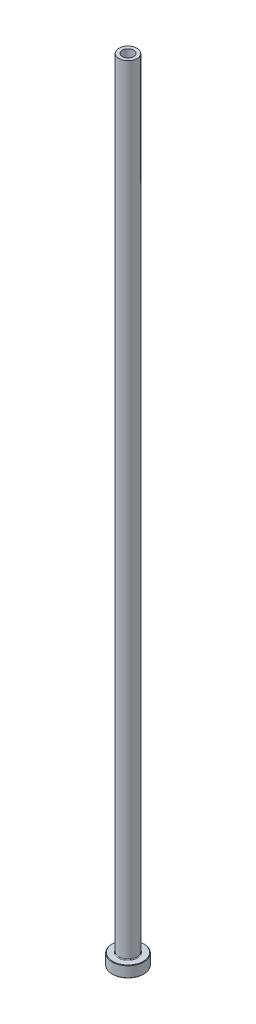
ISO-10303-21;
HEADER;
FILE_DESCRIPTION(('STEP AP214'),'2;1');
FILE_NAME('part.step','',(''),(''),'','','');
FILE_SCHEMA(('AUTOMOTIVE_DESIGN { 1 0 10303 214 1 1 1 1 }'));
ENDSEC;
DATA;
#1=APPLICATION_CONTEXT('core data for automotive mechanical design processes');
#2=APPLICATION_PROTOCOL_DEFINITION('international standard','automotive_design',2000,#1);
#3=PRODUCT_CONTEXT('',#1,'mechanical');
#4=PRODUCT('Part','Part','',(#3));
#5=PRODUCT_RELATED_PRODUCT_CATEGORY('part','',(#4));
#6=PRODUCT_DEFINITION_FORMATION('','',#4);
#7=PRODUCT_DEFINITION_CONTEXT('part definition',#1,'design');
#8=PRODUCT_DEFINITION('design','',#6,#7);
#9=PRODUCT_DEFINITION_SHAPE('','',#8);
#10=(LENGTH_UNIT() NAMED_UNIT(*) SI_UNIT(.MILLI.,.METRE.));
#11=(NAMED_UNIT(*) PLANE_ANGLE_UNIT() SI_UNIT($,.RADIAN.));
#12=(NAMED_UNIT(*) SI_UNIT($,.STERADIAN.) SOLID_ANGLE_UNIT());
#13=UNCERTAINTY_MEASURE_WITH_UNIT(LENGTH_MEASURE(1.E-05),#10,'distance_accuracy_value','');
#14=(GEOMETRIC_REPRESENTATION_CONTEXT(3) GLOBAL_UNCERTAINTY_ASSIGNED_CONTEXT((#13)) GLOBAL_UNIT_ASSIGNED_CONTEXT((#10,
#11,#12)) REPRESENTATION_CONTEXT('',''));
#15=CARTESIAN_POINT('',(0.,0.,0.));
#16=DIRECTION('',(0.,0.,1.));
#17=DIRECTION('',(1.,0.,0.));
#18=AXIS2_PLACEMENT_3D('',#15,#16,#17);
#19=CARTESIAN_POINT('',(0.,92.1876809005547,0.));
#20=DIRECTION('',(0.,1.,0.));
#21=DIRECTION('',(0.,0.,1.));
#22=AXIS2_PLACEMENT_3D('',#19,#20,#21);
#23=CYLINDRICAL_SURFACE('',#22,2.50000000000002);
#24=CARTESIAN_POINT('',(0.,350.,0.));
#25=DIRECTION('',(0.,1.,0.));
#26=DIRECTION('',(0.,0.,1.));
#27=AXIS2_PLACEMENT_3D('',#24,#25,#26);
#28=CIRCLE('',#27,2.50000000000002);
#29=CARTESIAN_POINT('',(0.,350.,2.50000000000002));
#30=VERTEX_POINT('',#29);
#31=EDGE_CURVE('E62',#30,#30,#28,.T.);
#32=ORIENTED_EDGE('',*,*,#31,.T.);
#33=EDGE_LOOP('',(#32));
#34=FACE_BOUND('',#33,.T.);
#35=CARTESIAN_POINT('',(0.,305.,0.));
#36=DIRECTION('',(0.,1.,0.));
#37=DIRECTION('',(0.,0.,1.));
#38=AXIS2_PLACEMENT_3D('',#35,#36,#37);
#39=CIRCLE('',#38,2.50000000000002);
#40=CARTESIAN_POINT('',(0.,305.,2.50000000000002));
#41=VERTEX_POINT('',#40);
#42=EDGE_CURVE('E71',#41,#41,#39,.T.);
#43=ORIENTED_EDGE('',*,*,#42,.F.);
#44=EDGE_LOOP('',(#43));
#45=FACE_BOUND('',#44,.T.);
#46=ADVANCED_FACE('F30',(#34,#45),#23,.F.);
#47=CARTESIAN_POINT('',(-2.50000000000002,350.,0.));
#48=DIRECTION('',(0.,1.,0.));
#49=DIRECTION('',(0.,0.,1.));
#50=AXIS2_PLACEMENT_3D('',#47,#48,#49);
#51=PLANE('',#50);
#52=CARTESIAN_POINT('',(0.,350.,0.));
#53=DIRECTION('',(0.,1.,0.));
#54=DIRECTION('',(0.,0.,1.));
#55=AXIS2_PLACEMENT_3D('',#52,#53,#54);
#56=CIRCLE('',#55,4.00000000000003);
#57=CARTESIAN_POINT('',(0.,350.,4.00000000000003));
#58=VERTEX_POINT('',#57);
#59=EDGE_CURVE('E65',#58,#58,#56,.T.);
#60=ORIENTED_EDGE('',*,*,#59,.T.);
#61=EDGE_LOOP('',(#60));
#62=FACE_BOUND('',#61,.T.);
#63=ORIENTED_EDGE('',*,*,#31,.F.);
#64=EDGE_LOOP('',(#63));
#65=FACE_BOUND('',#64,.T.);
#66=ADVANCED_FACE('F79',(#62,#65),#51,.T.);
#67=CARTESIAN_POINT('',(0.,92.1876809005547,0.));
#68=DIRECTION('',(0.,1.,0.));
#69=DIRECTION('',(0.,0.,1.));
#70=AXIS2_PLACEMENT_3D('',#67,#68,#69);
#71=CYLINDRICAL_SURFACE('',#70,4.00000000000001);
#72=CARTESIAN_POINT('',(0.,5.3,0.));
#73=DIRECTION('',(0.,1.,0.));
#74=DIRECTION('',(0.,0.,1.));
#75=AXIS2_PLACEMENT_3D('',#72,#73,#74);
#76=CIRCLE('',#75,4.00000000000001);
#77=CARTESIAN_POINT('',(0.,5.3,4.00000000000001));
#78=VERTEX_POINT('',#77);
#79=EDGE_CURVE('E59',#78,#78,#76,.T.);
#80=ORIENTED_EDGE('',*,*,#79,.T.);
#81=EDGE_LOOP('',(#80));
#82=FACE_BOUND('',#81,.T.);
#83=ORIENTED_EDGE('',*,*,#59,.F.);
#84=EDGE_LOOP('',(#83));
#85=FACE_BOUND('',#84,.T.);
#86=ADVANCED_FACE('F85',(#82,#85),#71,.T.);
#87=CARTESIAN_POINT('',(-3.99999999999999,5.,0.));
#88=DIRECTION('',(0.,1.,0.));
#89=DIRECTION('',(0.,0.,1.));
#90=AXIS2_PLACEMENT_3D('',#87,#88,#89);
#91=PLANE('',#90);
#92=CARTESIAN_POINT('',(0.,5.,0.));
#93=DIRECTION('',(0.,1.,0.));
#94=DIRECTION('',(0.,0.,1.));
#95=AXIS2_PLACEMENT_3D('',#92,#93,#94);
#96=CIRCLE('',#95,6.79999999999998);
#97=CARTESIAN_POINT('',(0.,5.,6.79999999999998));
#98=VERTEX_POINT('',#97);
#99=EDGE_CURVE('E53',#98,#98,#96,.T.);
#100=ORIENTED_EDGE('',*,*,#99,.T.);
#101=EDGE_LOOP('',(#100));
#102=FACE_BOUND('',#101,.T.);
#103=CARTESIAN_POINT('',(0.,5.,0.));
#104=DIRECTION('',(0.,1.,0.));
#105=DIRECTION('',(0.,0.,1.));
#106=AXIS2_PLACEMENT_3D('',#103,#104,#105);
#107=CIRCLE('',#106,4.30000000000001);
#108=CARTESIAN_POINT('',(0.,5.,4.30000000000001));
#109=VERTEX_POINT('',#108);
#110=EDGE_CURVE('E56',#109,#109,#107,.F.);
#111=ORIENTED_EDGE('',*,*,#110,.T.);
#112=EDGE_LOOP('',(#111));
#113=FACE_BOUND('',#112,.T.);
#114=ADVANCED_FACE('F111',(#102,#113),#91,.T.);
#115=CARTESIAN_POINT('',(0.,92.1876809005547,0.));
#116=DIRECTION('',(0.,1.,0.));
#117=DIRECTION('',(0.,0.,1.));
#118=AXIS2_PLACEMENT_3D('',#115,#116,#117);
#119=CYLINDRICAL_SURFACE('',#118,6.99999999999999);
#120=CARTESIAN_POINT('',(0.,4.8,0.));
#121=DIRECTION('',(0.,1.,0.));
#122=DIRECTION('',(0.,0.,1.));
#123=AXIS2_PLACEMENT_3D('',#120,#121,#122);
#124=CIRCLE('',#123,6.99999999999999);
#125=CARTESIAN_POINT('',(0.,4.8,6.99999999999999));
#126=VERTEX_POINT('',#125);
#127=EDGE_CURVE('E45',#126,#126,#124,.F.);
#128=ORIENTED_EDGE('',*,*,#127,.T.);
#129=EDGE_LOOP('',(#128));
#130=FACE_BOUND('',#129,.T.);
#131=CARTESIAN_POINT('',(0.,0.199999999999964,0.));
#132=DIRECTION('',(0.,-1.,0.));
#133=DIRECTION('',(0.,0.,-1.));
#134=AXIS2_PLACEMENT_3D('',#131,#132,#133);
#135=CIRCLE('',#134,6.99999999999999);
#136=CARTESIAN_POINT('',(0.,0.199999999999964,-6.99999999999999));
#137=VERTEX_POINT('',#136);
#138=EDGE_CURVE('E50',#137,#137,#135,.F.);
#139=ORIENTED_EDGE('',*,*,#138,.T.);
#140=EDGE_LOOP('',(#139));
#141=FACE_BOUND('',#140,.T.);
#142=ADVANCED_FACE('F108',(#130,#141),#119,.T.);
#143=CARTESIAN_POINT('',(-6.99999999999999,0.,0.));
#144=DIRECTION('',(0.,-1.,0.));
#145=DIRECTION('',(0.,0.,-1.));
#146=AXIS2_PLACEMENT_3D('',#143,#144,#145);
#147=PLANE('',#146);
#148=CARTESIAN_POINT('',(0.,0.,0.));
#149=DIRECTION('',(0.,-1.,0.));
#150=DIRECTION('',(0.,0.,-1.));
#151=AXIS2_PLACEMENT_3D('',#148,#149,#150);
#152=CIRCLE('',#151,3.25000000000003);
#153=CARTESIAN_POINT('',(0.,0.,-3.25000000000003));
#154=VERTEX_POINT('',#153);
#155=EDGE_CURVE('E37',#154,#154,#152,.F.);
#156=ORIENTED_EDGE('',*,*,#155,.T.);
#157=EDGE_LOOP('',(#156));
#158=FACE_BOUND('',#157,.T.);
#159=CARTESIAN_POINT('',(0.,0.,0.));
#160=DIRECTION('',(0.,-1.,0.));
#161=DIRECTION('',(0.,0.,-1.));
#162=AXIS2_PLACEMENT_3D('',#159,#160,#161);
#163=CIRCLE('',#162,6.80000000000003);
#164=CARTESIAN_POINT('',(0.,0.,-6.80000000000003));
#165=VERTEX_POINT('',#164);
#166=EDGE_CURVE('E41',#165,#165,#163,.T.);
#167=ORIENTED_EDGE('',*,*,#166,.T.);
#168=EDGE_LOOP('',(#167));
#169=FACE_BOUND('',#168,.T.);
#170=ADVANCED_FACE('F110',(#158,#169),#147,.T.);
#171=CARTESIAN_POINT('',(0.,92.1876809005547,0.));
#172=DIRECTION('',(0.,1.,0.));
#173=DIRECTION('',(0.,0.,1.));
#174=AXIS2_PLACEMENT_3D('',#171,#172,#173);
#175=CYLINDRICAL_SURFACE('',#174,2.75000000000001);
#176=CARTESIAN_POINT('',(0.,0.500000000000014,0.));
#177=DIRECTION('',(0.,-1.,0.));
#178=DIRECTION('',(0.,0.,-1.));
#179=AXIS2_PLACEMENT_3D('',#176,#177,#178);
#180=CIRCLE('',#179,2.75000000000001);
#181=CARTESIAN_POINT('',(0.,0.500000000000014,-2.75000000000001));
#182=VERTEX_POINT('',#181);
#183=EDGE_CURVE('E10',#182,#182,#180,.T.);
#184=ORIENTED_EDGE('',*,*,#183,.T.);
#185=EDGE_LOOP('',(#184));
#186=FACE_BOUND('',#185,.T.);
#187=CARTESIAN_POINT('',(0.,293.,0.));
#188=DIRECTION('',(0.,1.,0.));
#189=DIRECTION('',(0.,0.,1.));
#190=AXIS2_PLACEMENT_3D('',#187,#188,#189);
#191=CIRCLE('',#190,2.75000000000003);
#192=CARTESIAN_POINT('',(0.,293.,2.75000000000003));
#193=VERTEX_POINT('',#192);
#194=EDGE_CURVE('E68',#193,#193,#191,.T.);
#195=ORIENTED_EDGE('',*,*,#194,.T.);
#196=EDGE_LOOP('',(#195));
#197=FACE_BOUND('',#196,.T.);
#198=ADVANCED_FACE('F118',(#186,#197),#175,.F.);
#199=CARTESIAN_POINT('',(0.,293.,0.));
#200=DIRECTION('',(0.,-1.,0.));
#201=DIRECTION('',(0.,0.,-1.));
#202=AXIS2_PLACEMENT_3D('',#199,#200,#201);
#203=CONICAL_SURFACE('',#202,2.75000000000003,0.0208303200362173);
#204=ORIENTED_EDGE('',*,*,#42,.T.);
#205=EDGE_LOOP('',(#204));
#206=FACE_BOUND('',#205,.T.);
#207=ORIENTED_EDGE('',*,*,#194,.F.);
#208=EDGE_LOOP('',(#207));
#209=FACE_BOUND('',#208,.T.);
#210=ADVANCED_FACE('F75',(#206,#209),#203,.F.);
#211=CARTESIAN_POINT('',(0.,5.3,0.));
#212=DIRECTION('',(0.,1.,0.));
#213=DIRECTION('',(0.,0.,1.));
#214=AXIS2_PLACEMENT_3D('',#211,#212,#213);
#215=TOROIDAL_SURFACE('',#214,4.30000000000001,0.3);
#216=ORIENTED_EDGE('',*,*,#110,.F.);
#217=EDGE_LOOP('',(#216));
#218=FACE_BOUND('',#217,.T.);
#219=ORIENTED_EDGE('',*,*,#79,.F.);
#220=EDGE_LOOP('',(#219));
#221=FACE_BOUND('',#220,.T.);
#222=ADVANCED_FACE('F90',(#218,#221),#215,.F.);
#223=CARTESIAN_POINT('',(0.,5.,0.));
#224=DIRECTION('',(0.,-1.,0.));
#225=DIRECTION('',(0.,0.,-1.));
#226=AXIS2_PLACEMENT_3D('',#223,#224,#225);
#227=CONICAL_SURFACE('',#226,6.79999999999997,0.785398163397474);
#228=ORIENTED_EDGE('',*,*,#127,.F.);
#229=EDGE_LOOP('',(#228));
#230=FACE_BOUND('',#229,.T.);
#231=ORIENTED_EDGE('',*,*,#99,.F.);
#232=EDGE_LOOP('',(#231));
#233=FACE_BOUND('',#232,.T.);
#234=ADVANCED_FACE('F93',(#230,#233),#227,.T.);
#235=CARTESIAN_POINT('',(0.,0.199999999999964,0.));
#236=DIRECTION('',(0.,1.,0.));
#237=DIRECTION('',(0.,0.,1.));
#238=AXIS2_PLACEMENT_3D('',#235,#236,#237);
#239=CONICAL_SURFACE('',#238,6.99999999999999,0.78539816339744);
#240=ORIENTED_EDGE('',*,*,#166,.F.);
#241=EDGE_LOOP('',(#240));
#242=FACE_BOUND('',#241,.T.);
#243=ORIENTED_EDGE('',*,*,#138,.F.);
#244=EDGE_LOOP('',(#243));
#245=FACE_BOUND('',#244,.T.);
#246=ADVANCED_FACE('F96',(#242,#245),#239,.T.);
#247=CARTESIAN_POINT('',(0.,0.,0.));
#248=DIRECTION('',(0.,-1.,0.));
#249=DIRECTION('',(0.,0.,-1.));
#250=AXIS2_PLACEMENT_3D('',#247,#248,#249);
#251=CONICAL_SURFACE('',#250,3.25000000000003,0.785398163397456);
#252=ORIENTED_EDGE('',*,*,#183,.F.);
#253=EDGE_LOOP('',(#252));
#254=FACE_BOUND('',#253,.T.);
#255=ORIENTED_EDGE('',*,*,#155,.F.);
#256=EDGE_LOOP('',(#255));
#257=FACE_BOUND('',#256,.T.);
#258=ADVANCED_FACE('F32',(#254,#257),#251,.F.);
#259=CLOSED_SHELL('',(#46,#66,#86,#114,#142,#170,#198,#210,#222,#234,#246,#258));
#260=MANIFOLD_SOLID_BREP('B2',#259);
#261=ADVANCED_BREP_SHAPE_REPRESENTATION('',(#18,#260),#14);
#262=SHAPE_DEFINITION_REPRESENTATION(#9,#261);
ENDSEC;
END-ISO-10303-21;
